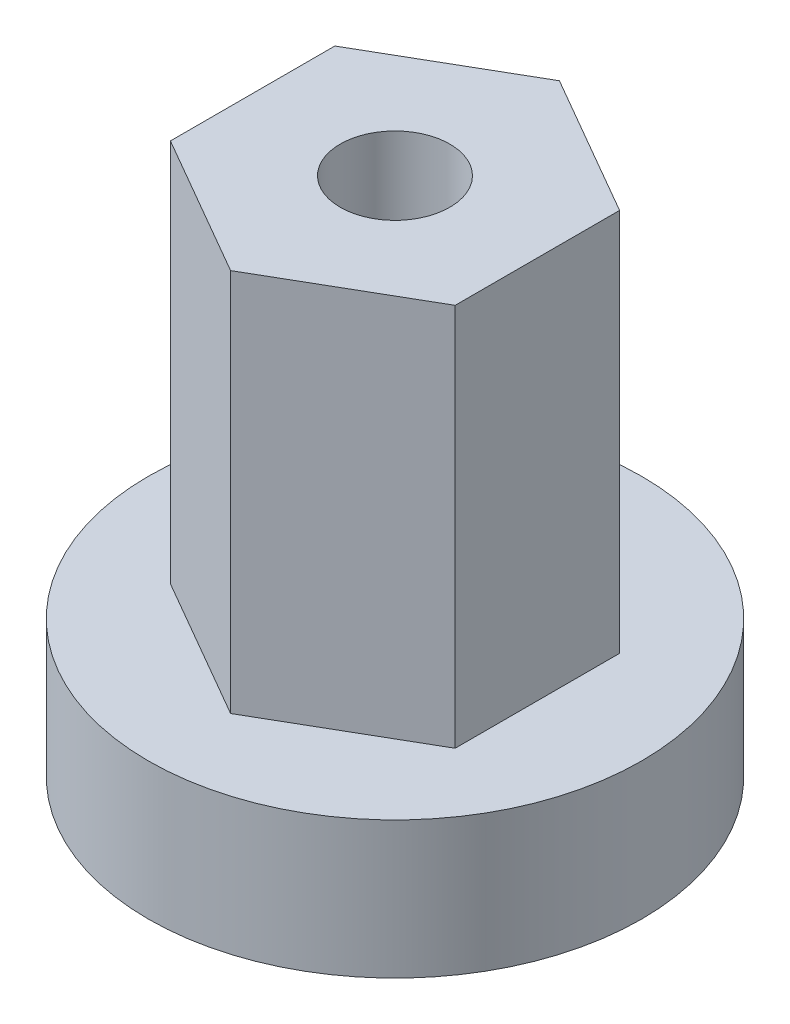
from build123d import *

# Parameters (mm, degrees)
SKETCH_1_R      = 18
EXTRUDE_1_DEPTH = 10
EXTRUDE_2_DEPTH = 28


with BuildPart() as part:
    # Sketch 1 → Extrude 1 (new body)
    with BuildSketch(Plane(origin=(0, 0, 0), x_dir=(1, 0, 0), z_dir=(0, 1, 0))):
        with Locations(Location((0, 0, 0), (0, 0, 270))):
            Circle(SKETCH_1_R)
    extrude(amount=EXTRUDE_1_DEPTH)

    # Sketch 2 → Extrude 2 (add)
    with BuildSketch(Plane(origin=(0, 10, 0), x_dir=(1, 0, 0), z_dir=(0, 1, 0))):
        Polygon((0, 12), (-10.392304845, 6), (-10.392304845, -6), (0, -12), (10.392304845, -6), (10.392304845, 6), align=None)
    extrude(amount=EXTRUDE_2_DEPTH)

    # Sketch 3 → Cut-Revolve 1 (revolve, cut)
    with BuildSketch(Plane.XY, mode=Mode.PRIVATE) as cut_revolve_1_sk:
        Polygon((0, 38), (-4, 38), (-4, 22), (-7, 22), (-7, 0), (0, 0), align=None)
    revolve(cut_revolve_1_sk.sketch.rotate(Axis((0, 39.010629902, 0), (0, -1, 0)), 270), axis=Axis((0, 39.010629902, 0), (0, -1, 0)), mode=Mode.SUBTRACT)


solid = part.part
